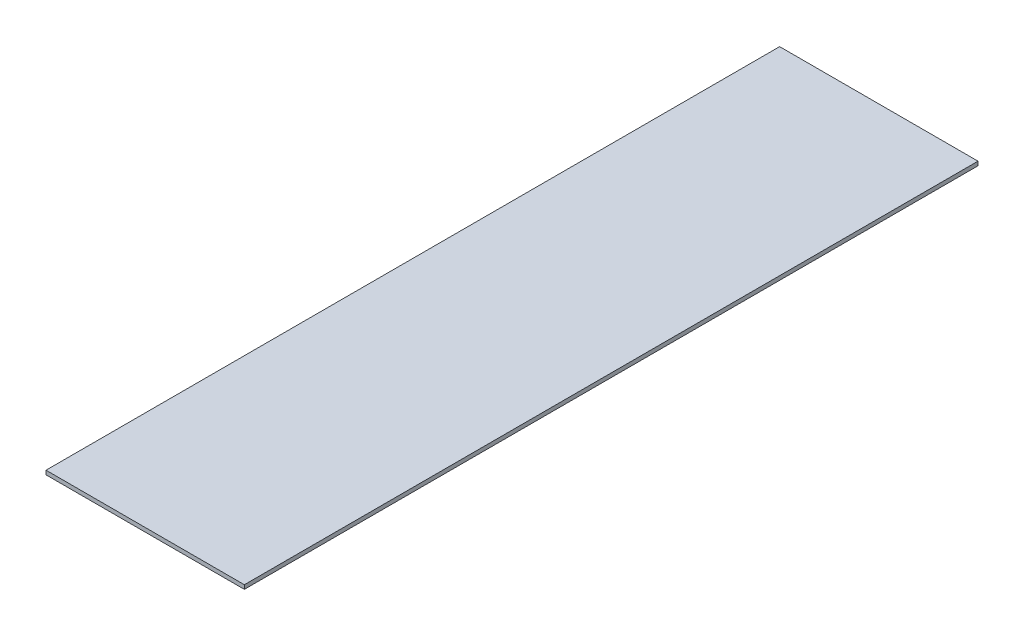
ISO-10303-21;
HEADER;
FILE_DESCRIPTION(('STEP AP214'),'2;1');
FILE_NAME('part.step','',(''),(''),'','','');
FILE_SCHEMA(('AUTOMOTIVE_DESIGN { 1 0 10303 214 1 1 1 1 }'));
ENDSEC;
DATA;
#1=APPLICATION_CONTEXT('core data for automotive mechanical design processes');
#2=APPLICATION_PROTOCOL_DEFINITION('international standard','automotive_design',2000,#1);
#3=PRODUCT_CONTEXT('',#1,'mechanical');
#4=PRODUCT('Part','Part','',(#3));
#5=PRODUCT_RELATED_PRODUCT_CATEGORY('part','',(#4));
#6=PRODUCT_DEFINITION_FORMATION('','',#4);
#7=PRODUCT_DEFINITION_CONTEXT('part definition',#1,'design');
#8=PRODUCT_DEFINITION('design','',#6,#7);
#9=PRODUCT_DEFINITION_SHAPE('','',#8);
#10=(LENGTH_UNIT() NAMED_UNIT(*) SI_UNIT(.MILLI.,.METRE.));
#11=(NAMED_UNIT(*) PLANE_ANGLE_UNIT() SI_UNIT($,.RADIAN.));
#12=(NAMED_UNIT(*) SI_UNIT($,.STERADIAN.) SOLID_ANGLE_UNIT());
#13=UNCERTAINTY_MEASURE_WITH_UNIT(LENGTH_MEASURE(1.E-05),#10,'distance_accuracy_value','');
#14=(GEOMETRIC_REPRESENTATION_CONTEXT(3) GLOBAL_UNCERTAINTY_ASSIGNED_CONTEXT((#13)) GLOBAL_UNIT_ASSIGNED_CONTEXT((#10,
#11,#12)) REPRESENTATION_CONTEXT('',''));
#15=CARTESIAN_POINT('',(0.,0.,0.));
#16=DIRECTION('',(0.,0.,1.));
#17=DIRECTION('',(1.,0.,0.));
#18=AXIS2_PLACEMENT_3D('',#15,#16,#17);
#19=CARTESIAN_POINT('',(-12.3027,0.5,-200.129625));
#20=DIRECTION('',(1.,0.,0.));
#21=DIRECTION('',(0.,0.,-1.));
#22=AXIS2_PLACEMENT_3D('',#19,#20,#21);
#23=PLANE('',#22);
#24=DIRECTION('',(0.,0.,1.));
#25=VECTOR('',#24,1.);
#26=CARTESIAN_POINT('',(-12.3027,0.,-200.129625));
#27=LINE('',#26,#25);
#28=CARTESIAN_POINT('',(-12.3027,0.,-200.129625));
#29=VERTEX_POINT('',#28);
#30=CARTESIAN_POINT('',(-12.3027,0.,-109.129625));
#31=VERTEX_POINT('',#30);
#32=EDGE_CURVE('E98',#29,#31,#27,.T.);
#33=ORIENTED_EDGE('',*,*,#32,.T.);
#34=DIRECTION('',(0.,-1.,0.));
#35=VECTOR('',#34,1.);
#36=CARTESIAN_POINT('',(-12.3027,0.5,-109.129625));
#37=LINE('',#36,#35);
#38=CARTESIAN_POINT('',(-12.3027,0.5,-109.129625));
#39=VERTEX_POINT('',#38);
#40=EDGE_CURVE('E11',#39,#31,#37,.T.);
#41=ORIENTED_EDGE('',*,*,#40,.F.);
#42=DIRECTION('',(0.,0.,1.));
#43=VECTOR('',#42,1.);
#44=CARTESIAN_POINT('',(-12.3027,0.5,-200.129625));
#45=LINE('',#44,#43);
#46=CARTESIAN_POINT('',(-12.3027,0.5,-200.129625));
#47=VERTEX_POINT('',#46);
#48=EDGE_CURVE('E86',#47,#39,#45,.T.);
#49=ORIENTED_EDGE('',*,*,#48,.F.);
#50=DIRECTION('',(0.,-1.,0.));
#51=VECTOR('',#50,1.);
#52=CARTESIAN_POINT('',(-12.3027,0.5,-200.129625));
#53=LINE('',#52,#51);
#54=EDGE_CURVE('E94',#47,#29,#53,.T.);
#55=ORIENTED_EDGE('',*,*,#54,.T.);
#56=EDGE_LOOP('',(#33,#41,#49,#55));
#57=FACE_BOUND('',#56,.T.);
#58=ADVANCED_FACE('F35',(#57),#23,.F.);
#59=CARTESIAN_POINT('',(-12.3027,0.5,-109.129625));
#60=DIRECTION('',(0.,0.,-1.));
#61=DIRECTION('',(-1.,0.,0.));
#62=AXIS2_PLACEMENT_3D('',#59,#60,#61);
#63=PLANE('',#62);
#64=DIRECTION('',(1.,0.,0.));
#65=VECTOR('',#64,1.);
#66=CARTESIAN_POINT('',(-12.3027,0.,-109.129625));
#67=LINE('',#66,#65);
#68=CARTESIAN_POINT('',(12.3027,0.,-109.129625));
#69=VERTEX_POINT('',#68);
#70=EDGE_CURVE('E90',#31,#69,#67,.T.);
#71=ORIENTED_EDGE('',*,*,#70,.T.);
#72=DIRECTION('',(0.,-1.,0.));
#73=VECTOR('',#72,1.);
#74=CARTESIAN_POINT('',(12.3027,0.5,-109.129625));
#75=LINE('',#74,#73);
#76=CARTESIAN_POINT('',(12.3027,0.5,-109.129625));
#77=VERTEX_POINT('',#76);
#78=EDGE_CURVE('E43',#77,#69,#75,.T.);
#79=ORIENTED_EDGE('',*,*,#78,.F.);
#80=DIRECTION('',(1.,0.,0.));
#81=VECTOR('',#80,1.);
#82=CARTESIAN_POINT('',(-12.3027,0.5,-109.129625));
#83=LINE('',#82,#81);
#84=EDGE_CURVE('E81',#39,#77,#83,.T.);
#85=ORIENTED_EDGE('',*,*,#84,.F.);
#86=ORIENTED_EDGE('',*,*,#40,.T.);
#87=EDGE_LOOP('',(#71,#79,#85,#86));
#88=FACE_BOUND('',#87,.T.);
#89=ADVANCED_FACE('F89',(#88),#63,.F.);
#90=CARTESIAN_POINT('',(12.3027,0.5,-200.129625));
#91=DIRECTION('',(-1.,0.,0.));
#92=DIRECTION('',(0.,0.,1.));
#93=AXIS2_PLACEMENT_3D('',#90,#91,#92);
#94=PLANE('',#93);
#95=DIRECTION('',(0.,0.,-1.));
#96=VECTOR('',#95,1.);
#97=CARTESIAN_POINT('',(12.3027,0.,-200.129625));
#98=LINE('',#97,#96);
#99=CARTESIAN_POINT('',(12.3027,0.,-200.129625));
#100=VERTEX_POINT('',#99);
#101=EDGE_CURVE('E68',#69,#100,#98,.T.);
#102=ORIENTED_EDGE('',*,*,#101,.T.);
#103=DIRECTION('',(0.,-1.,0.));
#104=VECTOR('',#103,1.);
#105=CARTESIAN_POINT('',(12.3027,0.5,-200.129625));
#106=LINE('',#105,#104);
#107=CARTESIAN_POINT('',(12.3027,0.5,-200.129625));
#108=VERTEX_POINT('',#107);
#109=EDGE_CURVE('E91',#108,#100,#106,.T.);
#110=ORIENTED_EDGE('',*,*,#109,.F.);
#111=DIRECTION('',(0.,0.,-1.));
#112=VECTOR('',#111,1.);
#113=CARTESIAN_POINT('',(12.3027,0.5,-200.129625));
#114=LINE('',#113,#112);
#115=EDGE_CURVE('E84',#77,#108,#114,.T.);
#116=ORIENTED_EDGE('',*,*,#115,.F.);
#117=ORIENTED_EDGE('',*,*,#78,.T.);
#118=EDGE_LOOP('',(#102,#110,#116,#117));
#119=FACE_BOUND('',#118,.T.);
#120=ADVANCED_FACE('F92',(#119),#94,.F.);
#121=CARTESIAN_POINT('',(-12.3027,0.5,-200.129625));
#122=DIRECTION('',(0.,0.,1.));
#123=DIRECTION('',(1.,0.,0.));
#124=AXIS2_PLACEMENT_3D('',#121,#122,#123);
#125=PLANE('',#124);
#126=DIRECTION('',(-1.,0.,0.));
#127=VECTOR('',#126,1.);
#128=CARTESIAN_POINT('',(-12.3027,0.,-200.129625));
#129=LINE('',#128,#127);
#130=EDGE_CURVE('E74',#100,#29,#129,.T.);
#131=ORIENTED_EDGE('',*,*,#130,.T.);
#132=ORIENTED_EDGE('',*,*,#54,.F.);
#133=DIRECTION('',(-1.,0.,0.));
#134=VECTOR('',#133,1.);
#135=CARTESIAN_POINT('',(-12.3027,0.5,-200.129625));
#136=LINE('',#135,#134);
#137=EDGE_CURVE('E51',#108,#47,#136,.T.);
#138=ORIENTED_EDGE('',*,*,#137,.F.);
#139=ORIENTED_EDGE('',*,*,#109,.T.);
#140=EDGE_LOOP('',(#131,#132,#138,#139));
#141=FACE_BOUND('',#140,.T.);
#142=ADVANCED_FACE('F105',(#141),#125,.F.);
#143=CARTESIAN_POINT('',(-12.3027,0.5,-109.129625));
#144=DIRECTION('',(0.,1.,0.));
#145=DIRECTION('',(0.,0.,1.));
#146=AXIS2_PLACEMENT_3D('',#143,#144,#145);
#147=PLANE('',#146);
#148=ORIENTED_EDGE('',*,*,#48,.T.);
#149=ORIENTED_EDGE('',*,*,#84,.T.);
#150=ORIENTED_EDGE('',*,*,#115,.T.);
#151=ORIENTED_EDGE('',*,*,#137,.T.);
#152=EDGE_LOOP('',(#148,#149,#150,#151));
#153=FACE_BOUND('',#152,.T.);
#154=ADVANCED_FACE('F82',(#153),#147,.T.);
#155=CARTESIAN_POINT('',(-12.3027,0.,-109.129625));
#156=DIRECTION('',(0.,1.,0.));
#157=DIRECTION('',(0.,0.,1.));
#158=AXIS2_PLACEMENT_3D('',#155,#156,#157);
#159=PLANE('',#158);
#160=ORIENTED_EDGE('',*,*,#32,.F.);
#161=ORIENTED_EDGE('',*,*,#130,.F.);
#162=ORIENTED_EDGE('',*,*,#101,.F.);
#163=ORIENTED_EDGE('',*,*,#70,.F.);
#164=EDGE_LOOP('',(#160,#161,#162,#163));
#165=FACE_BOUND('',#164,.T.);
#166=ADVANCED_FACE('F108',(#165),#159,.F.);
#167=CLOSED_SHELL('',(#58,#89,#120,#142,#154,#166));
#168=MANIFOLD_SOLID_BREP('B2',#167);
#169=ADVANCED_BREP_SHAPE_REPRESENTATION('',(#18,#168),#14);
#170=SHAPE_DEFINITION_REPRESENTATION(#9,#169);
ENDSEC;
END-ISO-10303-21;
